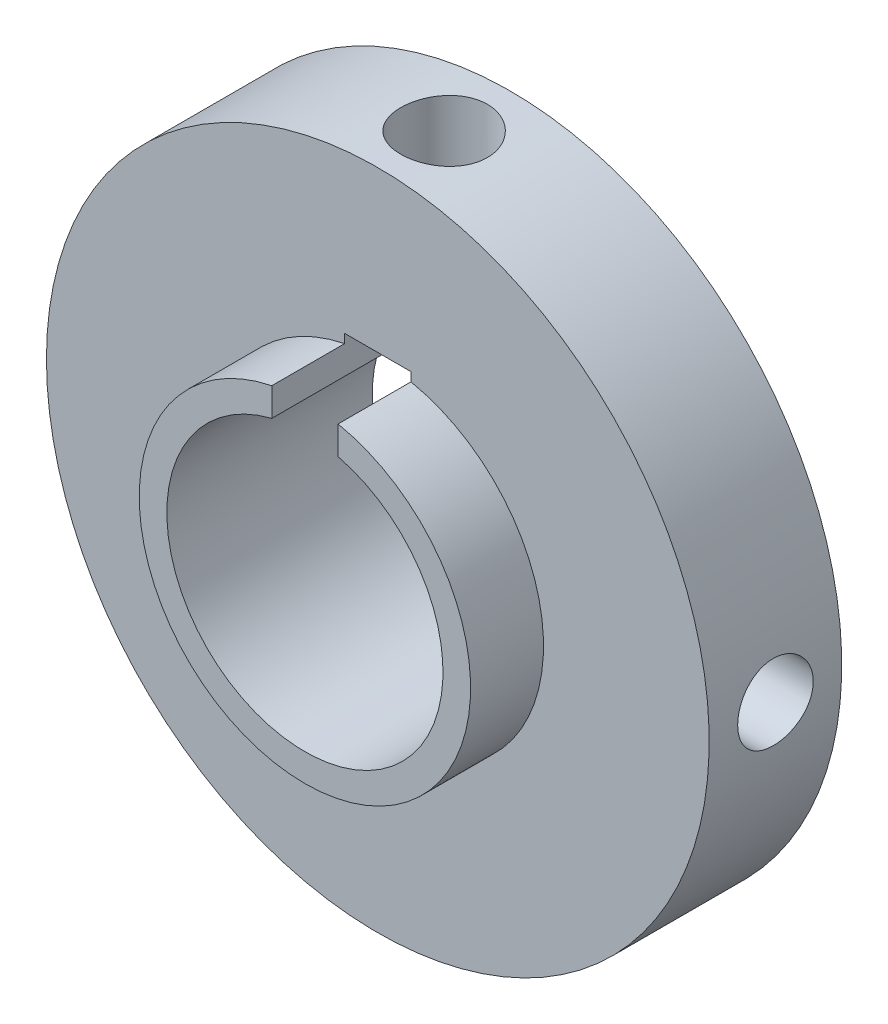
ISO-10303-21;
HEADER;
FILE_DESCRIPTION(('STEP AP214'),'2;1');
FILE_NAME('part.step','',(''),(''),'','','');
FILE_SCHEMA(('AUTOMOTIVE_DESIGN { 1 0 10303 214 1 1 1 1 }'));
ENDSEC;
DATA;
#1=APPLICATION_CONTEXT('core data for automotive mechanical design processes');
#2=APPLICATION_PROTOCOL_DEFINITION('international standard','automotive_design',2000,#1);
#3=PRODUCT_CONTEXT('',#1,'mechanical');
#4=PRODUCT('Part','Part','',(#3));
#5=PRODUCT_RELATED_PRODUCT_CATEGORY('part','',(#4));
#6=PRODUCT_DEFINITION_FORMATION('','',#4);
#7=PRODUCT_DEFINITION_CONTEXT('part definition',#1,'design');
#8=PRODUCT_DEFINITION('design','',#6,#7);
#9=PRODUCT_DEFINITION_SHAPE('','',#8);
#10=(LENGTH_UNIT() NAMED_UNIT(*) SI_UNIT(.MILLI.,.METRE.));
#11=(NAMED_UNIT(*) PLANE_ANGLE_UNIT() SI_UNIT($,.RADIAN.));
#12=(NAMED_UNIT(*) SI_UNIT($,.STERADIAN.) SOLID_ANGLE_UNIT());
#13=UNCERTAINTY_MEASURE_WITH_UNIT(LENGTH_MEASURE(1.E-05),#10,'distance_accuracy_value','');
#14=(GEOMETRIC_REPRESENTATION_CONTEXT(3) GLOBAL_UNCERTAINTY_ASSIGNED_CONTEXT((#13)) GLOBAL_UNIT_ASSIGNED_CONTEXT((#10,
#11,#12)) REPRESENTATION_CONTEXT('',''));
#15=CARTESIAN_POINT('',(0.,0.,0.));
#16=DIRECTION('',(0.,0.,1.));
#17=DIRECTION('',(1.,0.,0.));
#18=AXIS2_PLACEMENT_3D('',#15,#16,#17);
#19=CARTESIAN_POINT('',(0.,0.,-72.8201265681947));
#20=DIRECTION('',(0.,0.,-1.));
#21=DIRECTION('',(-1.,0.,0.));
#22=AXIS2_PLACEMENT_3D('',#19,#20,#21);
#23=CYLINDRICAL_SURFACE('',#22,19.05);
#24=CARTESIAN_POINT('',(0.,19.05,-10.4902));
#25=CARTESIAN_POINT('',(0.139183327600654,19.0499979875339,-10.4901941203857));
#26=CARTESIAN_POINT('',(0.278452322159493,19.0484585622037,-10.4784869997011));
#27=CARTESIAN_POINT('',(0.55311125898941,19.0424655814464,-10.4319718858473));
#28=CARTESIAN_POINT('',(0.688497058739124,19.0380090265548,-10.3971401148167));
#29=CARTESIAN_POINT('',(0.951373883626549,19.0266835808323,-10.3054226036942));
#30=CARTESIAN_POINT('',(1.07887029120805,19.0198163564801,-10.2485520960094));
#31=CARTESIAN_POINT('',(1.32248645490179,19.0044322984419,-10.1144056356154));
#32=CARTESIAN_POINT('',(1.43860807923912,18.9959157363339,-10.0371330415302));
#33=CARTESIAN_POINT('',(1.65689762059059,18.9781259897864,-9.86388113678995));
#34=CARTESIAN_POINT('',(1.75898751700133,18.9688489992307,-9.76780390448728));
#35=CARTESIAN_POINT('',(1.94564343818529,18.9506144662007,-9.55988039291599));
#36=CARTESIAN_POINT('',(2.03020854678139,18.9416569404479,-9.4480332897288));
#37=CARTESIAN_POINT('',(2.1797079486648,18.9250382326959,-9.21123408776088));
#38=CARTESIAN_POINT('',(2.24456861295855,18.9173819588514,-9.08623513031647));
#39=CARTESIAN_POINT('',(2.35234769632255,18.9042832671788,-8.82700190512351));
#40=CARTESIAN_POINT('',(2.39526702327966,18.8988407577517,-8.69276801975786));
#41=CARTESIAN_POINT('',(2.45770684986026,18.8908224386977,-8.41968764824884));
#42=CARTESIAN_POINT('',(2.47735951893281,18.8882304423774,-8.28087186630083));
#43=CARTESIAN_POINT('',(2.49311724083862,18.8861571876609,-8.00189020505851));
#44=CARTESIAN_POINT('',(2.4892233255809,18.8866757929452,-7.86172438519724));
#45=CARTESIAN_POINT('',(2.45810680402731,18.8907503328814,-7.58494518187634));
#46=CARTESIAN_POINT('',(2.43103012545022,18.8942872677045,-7.44831507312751));
#47=CARTESIAN_POINT('',(2.35454452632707,18.9039703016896,-7.18155453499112));
#48=CARTESIAN_POINT('',(2.30513511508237,18.9101164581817,-7.05142424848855));
#49=CARTESIAN_POINT('',(2.18523082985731,18.9243468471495,-6.80090591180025));
#50=CARTESIAN_POINT('',(2.11467288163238,18.9324368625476,-6.68054839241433));
#51=CARTESIAN_POINT('',(1.95451948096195,18.9496390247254,-6.45332677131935));
#52=CARTESIAN_POINT('',(1.86492307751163,18.9587512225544,-6.34646334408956));
#53=CARTESIAN_POINT('',(1.66842896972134,18.9770553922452,-6.14841661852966));
#54=CARTESIAN_POINT('',(1.56140554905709,18.9862474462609,-6.0573580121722));
#55=CARTESIAN_POINT('',(1.33352733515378,19.0036112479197,-5.89447777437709));
#56=CARTESIAN_POINT('',(1.21267250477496,19.0117829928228,-5.82265619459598));
#57=CARTESIAN_POINT('',(0.960463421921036,19.0261911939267,-5.70028734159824));
#58=CARTESIAN_POINT('',(0.829105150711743,19.0324269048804,-5.64974825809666));
#59=CARTESIAN_POINT('',(0.559666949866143,19.0422538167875,-5.57147998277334));
#60=CARTESIAN_POINT('',(0.42158736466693,19.0458451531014,-5.5437496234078));
#61=CARTESIAN_POINT('',(0.143703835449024,19.0499610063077,-5.51204845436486));
#62=CARTESIAN_POINT('',(0.00391979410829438,19.0505076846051,-5.50790594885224));
#63=CARTESIAN_POINT('',(-0.274349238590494,19.0485325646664,-5.52304441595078));
#64=CARTESIAN_POINT('',(-0.41283426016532,19.0460108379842,-5.54232484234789));
#65=CARTESIAN_POINT('',(-0.684064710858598,19.038196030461,-5.60361920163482));
#66=CARTESIAN_POINT('',(-0.816829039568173,19.032912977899,-5.64555089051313));
#67=CARTESIAN_POINT('',(-1.07344170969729,19.020166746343,-5.7508717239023));
#68=CARTESIAN_POINT('',(-1.19728972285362,19.0127034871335,-5.81426165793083));
#69=CARTESIAN_POINT('',(-1.43331849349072,18.996373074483,-5.96111231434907));
#70=CARTESIAN_POINT('',(-1.54542989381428,18.9874982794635,-6.04468364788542));
#71=CARTESIAN_POINT('',(-1.75409645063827,18.9693604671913,-6.22936886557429));
#72=CARTESIAN_POINT('',(-1.85065092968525,18.9600974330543,-6.33048351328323));
#73=CARTESIAN_POINT('',(-2.02607529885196,18.9421583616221,-6.54814314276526));
#74=CARTESIAN_POINT('',(-2.10483109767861,18.9334863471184,-6.66478045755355));
#75=CARTESIAN_POINT('',(-2.24163331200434,18.9177784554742,-6.90972830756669));
#76=CARTESIAN_POINT('',(-2.29968017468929,18.9107425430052,-7.03803859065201));
#77=CARTESIAN_POINT('',(-2.39323372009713,18.8991312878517,-7.30232790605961));
#78=CARTESIAN_POINT('',(-2.42880381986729,18.894549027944,-7.43828417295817));
#79=CARTESIAN_POINT('',(-2.47659789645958,18.8883443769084,-7.7143039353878));
#80=CARTESIAN_POINT('',(-2.48882306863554,18.8867218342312,-7.85436722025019));
#81=CARTESIAN_POINT('',(-2.48955695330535,18.8866250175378,-8.13348968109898));
#82=CARTESIAN_POINT('',(-2.47824493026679,18.8881269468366,-8.27254841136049));
#83=CARTESIAN_POINT('',(-2.4326061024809,18.8940585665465,-8.54676957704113));
#84=CARTESIAN_POINT('',(-2.39827930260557,18.8984882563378,-8.68193201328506));
#85=CARTESIAN_POINT('',(-2.30764297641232,18.9097687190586,-8.94449467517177));
#86=CARTESIAN_POINT('',(-2.25134291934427,18.9166184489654,-9.07189821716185));
#87=CARTESIAN_POINT('',(-2.11837584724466,18.9319688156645,-9.31547899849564));
#88=CARTESIAN_POINT('',(-2.04170848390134,18.9404694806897,-9.43165604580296));
#89=CARTESIAN_POINT('',(-1.86952076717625,18.9582413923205,-9.65040131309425));
#90=CARTESIAN_POINT('',(-1.77386694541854,18.9675178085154,-9.75286406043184));
#91=CARTESIAN_POINT('',(-1.56670135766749,18.9857508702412,-9.94035118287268));
#92=CARTESIAN_POINT('',(-1.45518587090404,18.9947074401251,-10.0253714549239));
#93=CARTESIAN_POINT('',(-1.21892803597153,19.0113330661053,-10.1758643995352));
#94=CARTESIAN_POINT('',(-1.09413272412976,19.0189966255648,-10.2412544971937));
#95=CARTESIAN_POINT('',(-0.835299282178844,19.032117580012,-10.350054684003));
#96=CARTESIAN_POINT('',(-0.701271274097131,19.0375773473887,-10.3934884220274));
#97=CARTESIAN_POINT('',(-0.472140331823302,19.0443740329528,-10.4468599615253));
#98=CARTESIAN_POINT('',(-0.37847635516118,19.0464733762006,-10.4630888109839));
#99=CARTESIAN_POINT('',(-0.189888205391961,19.0492870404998,-10.4847607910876));
#100=CARTESIAN_POINT('',(-0.0949640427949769,19.0500013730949,-10.4902040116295));
#101=CARTESIAN_POINT('',(0.,19.05,-10.4902));
#102=B_SPLINE_CURVE_WITH_KNOTS('',3,(#24,#25,#26,#27,#28,#29,#30,#31,#32,#33,#34,#35,#36,#37,
#38,#39,#40,#41,#42,#43,#44,#45,#46,#47,#48,#49,#50,#51,#52,#53,#54,#55,#56,#57,#58,#59,#60,#61,
#62,#63,#64,#65,#66,#67,#68,#69,#70,#71,#72,#73,#74,#75,#76,#77,#78,#79,#80,#81,#82,#83,#84,#85,
#86,#87,#88,#89,#90,#91,#92,#93,#94,#95,#96,#97,#98,#99,#100,#101),.UNSPECIFIED.,.T.,.F.,(4,2,2,
2,2,2,2,2,2,2,2,2,2,2,2,2,2,2,2,2,2,2,2,2,2,2,2,2,2,2,2,2,2,2,2,2,2,2,4),(0.,0.417203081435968,
0.834835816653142,1.25218041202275,1.66945634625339,2.08896593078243,2.50849744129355,
2.92957784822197,3.35064083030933,3.76930025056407,4.18794132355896,4.60396640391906,
5.02000062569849,5.43728820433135,5.85459663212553,6.27506093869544,6.69552637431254,
7.11615346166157,7.53675901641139,7.95429903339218,8.37182931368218,8.78785368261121,
9.20389336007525,9.62226721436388,10.0406592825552,10.4616616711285,10.8826549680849,
11.3024550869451,11.7222337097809,12.1388269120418,12.5554200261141,12.9718338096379,
13.3882547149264,13.8077137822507,14.2272714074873,14.6485699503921,15.0694137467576,
15.3540715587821,15.6387269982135),.UNSPECIFIED.);
#103=CARTESIAN_POINT('',(0.,19.05,-10.4902));
#104=VERTEX_POINT('',#103);
#105=EDGE_CURVE('E188',#104,#104,#102,.T.);
#106=ORIENTED_EDGE('',*,*,#105,.T.);
#107=EDGE_LOOP('',(#106));
#108=FACE_BOUND('',#107,.T.);
#109=CARTESIAN_POINT('',(0.,0.,-11.811));
#110=DIRECTION('',(0.,0.,-1.));
#111=DIRECTION('',(-1.,0.,0.));
#112=AXIS2_PLACEMENT_3D('',#109,#110,#111);
#113=CIRCLE('',#112,19.05);
#114=CARTESIAN_POINT('',(-19.05,0.,-11.811));
#115=VERTEX_POINT('',#114);
#116=EDGE_CURVE('E163',#115,#115,#113,.T.);
#117=ORIENTED_EDGE('',*,*,#116,.F.);
#118=EDGE_LOOP('',(#117));
#119=FACE_BOUND('',#118,.T.);
#120=CARTESIAN_POINT('',(0.,0.,-4.191));
#121=DIRECTION('',(0.,0.,-1.));
#122=DIRECTION('',(-1.,0.,0.));
#123=AXIS2_PLACEMENT_3D('',#120,#121,#122);
#124=CIRCLE('',#123,19.05);
#125=CARTESIAN_POINT('',(-19.05,0.,-4.191));
#126=VERTEX_POINT('',#125);
#127=EDGE_CURVE('E166',#126,#126,#124,.T.);
#128=ORIENTED_EDGE('',*,*,#127,.T.);
#129=EDGE_LOOP('',(#128));
#130=FACE_BOUND('',#129,.T.);
#131=CARTESIAN_POINT('',(19.05,0.,-5.8293));
#132=CARTESIAN_POINT('',(19.0499984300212,0.121562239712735,-5.82930521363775));
#133=CARTESIAN_POINT('',(19.0488241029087,0.243202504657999,-5.83954117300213));
#134=CARTESIAN_POINT('',(19.044252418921,0.483104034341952,-5.88021614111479));
#135=CARTESIAN_POINT('',(19.0408526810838,0.601361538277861,-5.91067678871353));
#136=CARTESIAN_POINT('',(19.0322135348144,0.830989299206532,-5.99089705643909));
#137=CARTESIAN_POINT('',(19.0269753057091,0.942363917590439,-6.04064430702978));
#138=CARTESIAN_POINT('',(19.0152432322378,1.15516050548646,-6.15799995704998));
#139=CARTESIAN_POINT('',(19.0087496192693,1.25658430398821,-6.22560506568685));
#140=CARTESIAN_POINT('',(18.9951993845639,1.44709104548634,-6.37709156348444));
#141=CARTESIAN_POINT('',(18.988140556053,1.53612148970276,-6.46103878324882));
#142=CARTESIAN_POINT('',(18.9742734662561,1.69886253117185,-6.64268553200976));
#143=CARTESIAN_POINT('',(18.9674652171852,1.77257238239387,-6.7403857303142));
#144=CARTESIAN_POINT('',(18.9548481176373,1.90277133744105,-6.94710088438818));
#145=CARTESIAN_POINT('',(18.9490420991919,1.95921197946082,-7.05614655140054));
#146=CARTESIAN_POINT('',(18.9391152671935,2.05296092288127,-7.28224527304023));
#147=CARTESIAN_POINT('',(18.9349944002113,2.09026983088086,-7.39929807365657));
#148=CARTESIAN_POINT('',(18.9289250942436,2.14453836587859,-7.63754733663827));
#149=CARTESIAN_POINT('',(18.9269672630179,2.16158599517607,-7.75872351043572));
#150=CARTESIAN_POINT('',(18.9254167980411,2.17512023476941,-8.00223160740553));
#151=CARTESIAN_POINT('',(18.925824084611,2.17160753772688,-8.12456349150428));
#152=CARTESIAN_POINT('',(18.9289492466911,2.14419320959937,-8.36630028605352));
#153=CARTESIAN_POINT('',(18.9316561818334,2.12038811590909,-8.48571630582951));
#154=CARTESIAN_POINT('',(18.9390585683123,2.05321516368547,-8.71884729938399));
#155=CARTESIAN_POINT('',(18.9437540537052,2.00984697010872,-8.83256217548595));
#156=CARTESIAN_POINT('',(18.954616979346,1.90467381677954,-9.05136520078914));
#157=CARTESIAN_POINT('',(18.9607877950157,1.84282649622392,-9.15643281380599));
#158=CARTESIAN_POINT('',(18.9739033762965,1.70248107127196,-9.35473394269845));
#159=CARTESIAN_POINT('',(18.9808481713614,1.62398233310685,-9.44796700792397));
#160=CARTESIAN_POINT('',(18.9947779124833,1.45202540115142,-9.62051313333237));
#161=CARTESIAN_POINT('',(19.0017628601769,1.35848392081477,-9.69974321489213));
#162=CARTESIAN_POINT('',(19.0149484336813,1.15938470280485,-9.84138961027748));
#163=CARTESIAN_POINT('',(19.0211490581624,1.0538269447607,-9.90380589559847));
#164=CARTESIAN_POINT('',(19.0320703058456,0.833630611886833,-10.010051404));
#165=CARTESIAN_POINT('',(19.0367905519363,0.718989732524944,-10.0538758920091));
#166=CARTESIAN_POINT('',(19.0442156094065,0.48391082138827,-10.1216302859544));
#167=CARTESIAN_POINT('',(19.0469204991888,0.363473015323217,-10.1455609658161));
#168=CARTESIAN_POINT('',(19.049999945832,0.120937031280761,-10.1727419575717));
#169=CARTESIAN_POINT('',(19.0503873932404,-0.00114816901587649,-10.1761066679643));
#170=CARTESIAN_POINT('',(19.0488229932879,-0.244143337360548,-10.1623614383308));
#171=CARTESIAN_POINT('',(19.0468711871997,-0.365053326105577,-10.1452518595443));
#172=CARTESIAN_POINT('',(19.0408557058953,-0.601931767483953,-10.0911387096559));
#173=CARTESIAN_POINT('',(19.0367977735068,-0.717912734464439,-10.0541892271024));
#174=CARTESIAN_POINT('',(19.0270247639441,-0.942031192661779,-9.96150105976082));
#175=CARTESIAN_POINT('',(19.0213096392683,-1.05016845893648,-9.9057618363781));
#176=CARTESIAN_POINT('',(19.008828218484,-1.25604377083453,-9.77679640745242));
#177=CARTESIAN_POINT('',(19.0020574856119,-1.35373484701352,-9.70349565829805));
#178=CARTESIAN_POINT('',(18.9882374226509,-1.53546794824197,-9.54159403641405));
#179=CARTESIAN_POINT('',(18.9811880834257,-1.61950952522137,-9.45299266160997));
#180=CARTESIAN_POINT('',(18.967565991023,-1.77195984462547,-9.26250312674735));
#181=CARTESIAN_POINT('',(18.9609956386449,-1.84029310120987,-9.16055435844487));
#182=CARTESIAN_POINT('',(18.9491136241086,-1.9588667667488,-8.94656033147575));
#183=CARTESIAN_POINT('',(18.9438019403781,-2.00910748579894,-8.83451524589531));
#184=CARTESIAN_POINT('',(18.9350544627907,-2.08994576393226,-8.60375982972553));
#185=CARTESIAN_POINT('',(18.9316145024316,-2.1205869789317,-8.48506495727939));
#186=CARTESIAN_POINT('',(18.9269875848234,-2.16149756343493,-8.24417333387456));
#187=CARTESIAN_POINT('',(18.9258005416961,-2.17176770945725,-8.12197671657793));
#188=CARTESIAN_POINT('',(18.925816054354,-2.17163200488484,-7.87830092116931));
#189=CARTESIAN_POINT('',(18.9270049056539,-2.16134473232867,-7.75682165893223));
#190=CARTESIAN_POINT('',(18.9316089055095,-2.12063615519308,-7.51732997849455));
#191=CARTESIAN_POINT('',(18.9350240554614,-2.09021483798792,-7.399317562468));
#192=CARTESIAN_POINT('',(18.9436918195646,-2.01013681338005,-7.17011833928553));
#193=CARTESIAN_POINT('',(18.9489439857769,-1.96048479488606,-7.05892987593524));
#194=CARTESIAN_POINT('',(18.9606948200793,-1.84336662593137,-6.84644475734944));
#195=CARTESIAN_POINT('',(18.9671934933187,-1.7759004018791,-6.74514814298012));
#196=CARTESIAN_POINT('',(18.9807500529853,-1.62462611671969,-6.55471503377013));
#197=CARTESIAN_POINT('',(18.987810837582,-1.54072960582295,-6.46564900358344));
#198=CARTESIAN_POINT('',(19.0016699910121,-1.35915769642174,-6.30281157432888));
#199=CARTESIAN_POINT('',(19.0084682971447,-1.26147903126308,-6.22904381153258));
#200=CARTESIAN_POINT('',(19.0210599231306,-1.05476434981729,-6.09870247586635));
#201=CARTESIAN_POINT('',(19.0268499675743,-0.945693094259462,-6.04218450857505));
#202=CARTESIAN_POINT('',(19.0367386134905,-0.719607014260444,-5.94834454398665));
#203=CARTESIAN_POINT('',(19.0408390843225,-0.602601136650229,-5.91100132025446));
#204=CARTESIAN_POINT('',(19.0458784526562,-0.404135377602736,-5.86568474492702));
#205=CARTESIAN_POINT('',(19.0474166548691,-0.323935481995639,-5.85205961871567));
#206=CARTESIAN_POINT('',(19.0494779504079,-0.162502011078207,-5.833865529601));
#207=CARTESIAN_POINT('',(19.0500010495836,-0.0812684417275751,-5.82929651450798));
#208=CARTESIAN_POINT('',(19.05,0.,-5.8293));
#209=B_SPLINE_CURVE_WITH_KNOTS('',3,(#131,#132,#133,#134,#135,#136,#137,#138,#139,#140,#141,
#142,#143,#144,#145,#146,#147,#148,#149,#150,#151,#152,#153,#154,#155,#156,#157,#158,#159,#160,
#161,#162,#163,#164,#165,#166,#167,#168,#169,#170,#171,#172,#173,#174,#175,#176,#177,#178,#179,
#180,#181,#182,#183,#184,#185,#186,#187,#188,#189,#190,#191,#192,#193,#194,#195,#196,#197,#198,
#199,#200,#201,#202,#203,#204,#205,#206,#207,#208),.UNSPECIFIED.,.T.,.F.,(4,2,2,2,2,2,2,2,2,2,2,
2,2,2,2,2,2,2,2,2,2,2,2,2,2,2,2,2,2,2,2,2,2,2,2,2,2,2,4),(0.,0.364389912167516,
0.729170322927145,1.0937171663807,1.45819687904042,1.82417639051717,2.19017371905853,
2.55718890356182,2.92419245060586,3.28959606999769,3.65498737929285,4.01865004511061,
4.38231893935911,4.74682797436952,5.11135088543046,5.47796630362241,5.84458234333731,
6.21129169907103,6.57798678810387,6.94264026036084,7.30728729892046,7.67094522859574,
8.03461358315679,8.39985384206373,8.76510608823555,9.13207846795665,9.49904455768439,
9.86519039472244,10.2313222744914,10.5953483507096,10.9593746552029,11.3233122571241,
11.6872513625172,12.0532063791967,12.4192482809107,12.7864579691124,13.1532602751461,
13.396868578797,13.6404754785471),.UNSPECIFIED.);
#210=CARTESIAN_POINT('',(19.05,0.,-5.8293));
#211=VERTEX_POINT('',#210);
#212=EDGE_CURVE('E232',#211,#211,#209,.T.);
#213=ORIENTED_EDGE('',*,*,#212,.T.);
#214=EDGE_LOOP('',(#213));
#215=FACE_BOUND('',#214,.T.);
#216=ADVANCED_FACE('F34',(#108,#119,#130,#215),#23,.T.);
#217=CARTESIAN_POINT('',(0.,0.,-72.8201265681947));
#218=DIRECTION('',(0.,0.,-1.));
#219=DIRECTION('',(-1.,0.,0.));
#220=AXIS2_PLACEMENT_3D('',#217,#218,#219);
#221=CYLINDRICAL_SURFACE('',#220,7.93750000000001);
#222=CARTESIAN_POINT('',(-1.905,7.70550979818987,-9.60321460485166));
#223=CARTESIAN_POINT('',(-1.94925234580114,7.69456907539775,-9.55059524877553));
#224=CARTESIAN_POINT('',(-1.99132159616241,7.68376449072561,-9.49615175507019));
#225=CARTESIAN_POINT('',(-2.07086297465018,7.66271007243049,-9.3838897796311));
#226=CARTESIAN_POINT('',(-2.10833432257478,7.65246033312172,-9.32607072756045));
#227=CARTESIAN_POINT('',(-2.21350847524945,7.62296581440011,-9.14794583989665));
#228=CARTESIAN_POINT('',(-2.27393957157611,7.60498392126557,-9.02301010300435));
#229=CARTESIAN_POINT('',(-2.3734254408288,7.57452936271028,-8.76405715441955));
#230=CARTESIAN_POINT('',(-2.41244377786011,7.56206609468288,-8.63002489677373));
#231=CARTESIAN_POINT('',(-2.46753829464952,7.54427032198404,-8.35698353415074));
#232=CARTESIAN_POINT('',(-2.48364170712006,7.53892935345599,-8.21798053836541));
#233=CARTESIAN_POINT('',(-2.49219586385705,7.53610516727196,-7.94379298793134));
#234=CARTESIAN_POINT('',(-2.48541133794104,7.53836788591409,-7.80863420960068));
#235=CARTESIAN_POINT('',(-2.45011371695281,7.54991291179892,-7.5414003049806));
#236=CARTESIAN_POINT('',(-2.42158548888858,7.55920010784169,-7.40932739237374));
#237=CARTESIAN_POINT('',(-2.34413262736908,7.58357229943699,-7.15308996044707));
#238=CARTESIAN_POINT('',(-2.29537240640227,7.59861048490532,-7.02887078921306));
#239=CARTESIAN_POINT('',(-2.17900096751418,7.63279155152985,-6.79036729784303));
#240=CARTESIAN_POINT('',(-2.11141720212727,7.65192844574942,-6.67606882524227));
#241=CARTESIAN_POINT('',(-2.01487655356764,7.67754059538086,-6.53892305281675));
#242=CARTESIAN_POINT('',(-1.99371941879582,7.68306538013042,-6.51020342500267));
#243=CARTESIAN_POINT('',(-1.95023582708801,7.69421793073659,-6.45375714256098));
#244=CARTESIAN_POINT('',(-1.927911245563,7.69984552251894,-6.42602900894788));
#245=CARTESIAN_POINT('',(-1.90500000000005,7.70550979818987,-6.39878539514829));
#246=B_SPLINE_CURVE_WITH_KNOTS('',3,(#222,#223,#224,#225,#226,#227,#228,#229,#230,#231,#232,
#233,#234,#235,#236,#237,#238,#239,#240,#241,#242,#243,#244,#245),.UNSPECIFIED.,.F.,.F.,(4,2,2,
2,2,2,2,2,2,2,2,4),(0.,0.208735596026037,0.417506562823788,0.835196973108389,1.25359593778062,
1.67149724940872,2.07557584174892,2.47993591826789,2.88107244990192,3.28162699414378,
3.38989694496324,3.4979980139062),.UNSPECIFIED.);
#247=CARTESIAN_POINT('',(-1.905,7.70550979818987,-9.60321460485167));
#248=VERTEX_POINT('',#247);
#249=CARTESIAN_POINT('',(-1.905,7.70550979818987,-6.39878539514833));
#250=VERTEX_POINT('',#249);
#251=EDGE_CURVE('E131',#248,#250,#246,.T.);
#252=ORIENTED_EDGE('',*,*,#251,.T.);
#253=DIRECTION('',(0.,0.,-1.));
#254=VECTOR('',#253,1.);
#255=CARTESIAN_POINT('',(-1.905,7.70550979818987,23.8357719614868));
#256=LINE('',#255,#254);
#257=CARTESIAN_POINT('',(-1.905,7.70550979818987,0.));
#258=VERTEX_POINT('',#257);
#259=EDGE_CURVE('E201',#258,#250,#256,.T.);
#260=ORIENTED_EDGE('',*,*,#259,.F.);
#261=CARTESIAN_POINT('',(0.,0.,0.));
#262=DIRECTION('',(0.,0.,-1.));
#263=DIRECTION('',(-1.,0.,0.));
#264=AXIS2_PLACEMENT_3D('',#261,#262,#263);
#265=CIRCLE('',#264,7.93750000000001);
#266=CARTESIAN_POINT('',(1.905,7.70550979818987,0.));
#267=VERTEX_POINT('',#266);
#268=EDGE_CURVE('E158',#267,#258,#265,.T.);
#269=ORIENTED_EDGE('',*,*,#268,.F.);
#270=DIRECTION('',(0.,0.,-1.));
#271=VECTOR('',#270,1.);
#272=CARTESIAN_POINT('',(1.905,7.70550979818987,23.8357719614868));
#273=LINE('',#272,#271);
#274=CARTESIAN_POINT('',(1.905,7.70550979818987,-6.39878539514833));
#275=VERTEX_POINT('',#274);
#276=EDGE_CURVE('E138',#267,#275,#273,.T.);
#277=ORIENTED_EDGE('',*,*,#276,.T.);
#278=CARTESIAN_POINT('',(1.905,7.70550979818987,-6.39878539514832));
#279=CARTESIAN_POINT('',(1.94925234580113,7.69456907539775,-6.45140475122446));
#280=CARTESIAN_POINT('',(1.9913215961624,7.68376449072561,-6.5058482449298));
#281=CARTESIAN_POINT('',(2.07086297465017,7.66271007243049,-6.61811022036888));
#282=CARTESIAN_POINT('',(2.10833432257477,7.65246033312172,-6.67592927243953));
#283=CARTESIAN_POINT('',(2.21350847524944,7.62296581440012,-6.85405416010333));
#284=CARTESIAN_POINT('',(2.27393957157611,7.60498392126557,-6.97898989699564));
#285=CARTESIAN_POINT('',(2.3734254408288,7.57452936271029,-7.23794284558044));
#286=CARTESIAN_POINT('',(2.41244377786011,7.56206609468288,-7.37197510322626));
#287=CARTESIAN_POINT('',(2.46753829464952,7.54427032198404,-7.64501646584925));
#288=CARTESIAN_POINT('',(2.48364170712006,7.53892935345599,-7.78401946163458));
#289=CARTESIAN_POINT('',(2.49219586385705,7.53610516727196,-8.05820701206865));
#290=CARTESIAN_POINT('',(2.48541133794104,7.53836788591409,-8.19336579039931));
#291=CARTESIAN_POINT('',(2.45011371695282,7.54991291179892,-8.46059969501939));
#292=CARTESIAN_POINT('',(2.42158548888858,7.55920010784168,-8.59267260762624));
#293=CARTESIAN_POINT('',(2.34413262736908,7.58357229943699,-8.84891003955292));
#294=CARTESIAN_POINT('',(2.29537240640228,7.59861048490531,-8.97312921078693));
#295=CARTESIAN_POINT('',(2.17900096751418,7.63279155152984,-9.21163270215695));
#296=CARTESIAN_POINT('',(2.11141720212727,7.65192844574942,-9.32593117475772));
#297=CARTESIAN_POINT('',(2.01487655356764,7.67754059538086,-9.46307694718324));
#298=CARTESIAN_POINT('',(1.99371941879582,7.68306538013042,-9.49179657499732));
#299=CARTESIAN_POINT('',(1.95023582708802,7.69421793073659,-9.54824285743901));
#300=CARTESIAN_POINT('',(1.92791124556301,7.69984552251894,-9.57597099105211));
#301=CARTESIAN_POINT('',(1.90500000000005,7.70550979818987,-9.6032146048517));
#302=B_SPLINE_CURVE_WITH_KNOTS('',3,(#278,#279,#280,#281,#282,#283,#284,#285,#286,#287,#288,
#289,#290,#291,#292,#293,#294,#295,#296,#297,#298,#299,#300,#301),.UNSPECIFIED.,.F.,.F.,(4,2,2,
2,2,2,2,2,2,2,2,4),(0.,0.208735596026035,0.417506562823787,0.83519697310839,1.25359593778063,
1.67149724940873,2.07557584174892,2.47993591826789,2.88107244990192,3.28162699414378,
3.38989694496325,3.4979980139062),.UNSPECIFIED.);
#303=CARTESIAN_POINT('',(1.905,7.70550979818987,-9.60321460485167));
#304=VERTEX_POINT('',#303);
#305=EDGE_CURVE('E117',#275,#304,#302,.T.);
#306=ORIENTED_EDGE('',*,*,#305,.T.);
#307=CARTESIAN_POINT('',(1.905,7.70550979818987,-11.811));
#308=VERTEX_POINT('',#307);
#309=EDGE_CURVE('E57',#304,#308,#273,.T.);
#310=ORIENTED_EDGE('',*,*,#309,.T.);
#311=CARTESIAN_POINT('',(0.,0.,-11.811));
#312=DIRECTION('',(0.,0.,-1.));
#313=DIRECTION('',(-1.,0.,0.));
#314=AXIS2_PLACEMENT_3D('',#311,#312,#313);
#315=CIRCLE('',#314,7.93750000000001);
#316=CARTESIAN_POINT('',(-1.905,7.70550979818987,-11.811));
#317=VERTEX_POINT('',#316);
#318=EDGE_CURVE('E161',#308,#317,#315,.T.);
#319=ORIENTED_EDGE('',*,*,#318,.T.);
#320=EDGE_CURVE('E202',#248,#317,#256,.T.);
#321=ORIENTED_EDGE('',*,*,#320,.F.);
#322=EDGE_LOOP('',(#252,#260,#269,#277,#306,#310,#319,#321));
#323=FACE_BOUND('',#322,.T.);
#324=CARTESIAN_POINT('',(7.93750000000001,0.,-5.8293));
#325=CARTESIAN_POINT('',(7.93749831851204,-0.119603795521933,-5.82930259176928));
#326=CARTESIAN_POINT('',(7.93477022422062,-0.239234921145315,-5.83921361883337));
#327=CARTESIAN_POINT('',(7.92415254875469,-0.475043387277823,-5.87852097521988));
#328=CARTESIAN_POINT('',(7.91626067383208,-0.59121916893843,-5.90792596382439));
#329=CARTESIAN_POINT('',(7.89618524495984,-0.816679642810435,-5.98518799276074));
#330=CARTESIAN_POINT('',(7.88400738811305,-0.925973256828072,-6.03302054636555));
#331=CARTESIAN_POINT('',(7.85664270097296,-1.13498762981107,-6.14568718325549));
#332=CARTESIAN_POINT('',(7.84145562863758,-1.23470761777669,-6.21052263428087));
#333=CARTESIAN_POINT('',(7.80929562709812,-1.42416712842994,-6.35701739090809));
#334=CARTESIAN_POINT('',(7.79229092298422,-1.51364091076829,-6.43901340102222));
#335=CARTESIAN_POINT('',(7.75861325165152,-1.67775445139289,-6.61678239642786));
#336=CARTESIAN_POINT('',(7.74194032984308,-1.75239219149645,-6.71255725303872));
#337=CARTESIAN_POINT('',(7.71048682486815,-1.88603083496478,-6.91731160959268));
#338=CARTESIAN_POINT('',(7.69574621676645,-1.94472233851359,-7.02649975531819));
#339=CARTESIAN_POINT('',(7.67029507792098,-2.04280821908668,-7.25366296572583));
#340=CARTESIAN_POINT('',(7.65958376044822,-2.08220636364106,-7.37163630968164));
#341=CARTESIAN_POINT('',(7.64373265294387,-2.13965718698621,-7.61006942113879));
#342=CARTESIAN_POINT('',(7.6384669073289,-2.15819334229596,-7.7304041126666));
#343=CARTESIAN_POINT('',(7.63372713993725,-2.17490185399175,-7.97258153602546));
#344=CARTESIAN_POINT('',(7.63425197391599,-2.1730782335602,-8.09442396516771));
#345=CARTESIAN_POINT('',(7.64092154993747,-2.1495019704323,-8.33235405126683));
#346=CARTESIAN_POINT('',(7.64690018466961,-2.12833833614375,-8.4485054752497));
#347=CARTESIAN_POINT('',(7.66353720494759,-2.06762781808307,-8.67554247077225));
#348=CARTESIAN_POINT('',(7.67419598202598,-2.02807939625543,-8.78642760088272));
#349=CARTESIAN_POINT('',(7.69913564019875,-1.93125133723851,-9.00130072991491));
#350=CARTESIAN_POINT('',(7.7134577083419,-1.87376832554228,-9.10519209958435));
#351=CARTESIAN_POINT('',(7.74408854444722,-1.74284457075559,-9.30205938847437));
#352=CARTESIAN_POINT('',(7.7603977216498,-1.66940053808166,-9.39503305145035));
#353=CARTESIAN_POINT('',(7.79385306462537,-1.50564504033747,-9.57078634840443));
#354=CARTESIAN_POINT('',(7.81100871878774,-1.41484006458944,-9.65310503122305));
#355=CARTESIAN_POINT('',(7.84372187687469,-1.22050336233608,-9.80144309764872));
#356=CARTESIAN_POINT('',(7.85927931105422,-1.11697108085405,-9.86746177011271));
#357=CARTESIAN_POINT('',(7.88714733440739,-0.899380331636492,-9.98154366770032));
#358=CARTESIAN_POINT('',(7.8994420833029,-0.785274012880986,-10.029519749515));
#359=CARTESIAN_POINT('',(7.91928512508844,-0.550201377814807,-10.1054729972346));
#360=CARTESIAN_POINT('',(7.92683451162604,-0.429236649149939,-10.1334547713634));
#361=CARTESIAN_POINT('',(7.93616930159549,-0.187811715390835,-10.1678927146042));
#362=CARTESIAN_POINT('',(7.93812235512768,-0.0674471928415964,-10.1749751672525));
#363=CARTESIAN_POINT('',(7.93652838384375,0.17275111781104,-10.1691481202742));
#364=CARTESIAN_POINT('',(7.93298195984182,0.292584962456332,-10.1562408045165));
#365=CARTESIAN_POINT('',(7.92089613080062,0.526059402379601,-10.1113130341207));
#366=CARTESIAN_POINT('',(7.91244890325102,0.639773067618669,-10.0796452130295));
#367=CARTESIAN_POINT('',(7.8915228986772,0.860260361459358,-9.99850778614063));
#368=CARTESIAN_POINT('',(7.87904367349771,0.967033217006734,-9.94903620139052));
#369=CARTESIAN_POINT('',(7.85104911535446,1.17301600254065,-9.83255618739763));
#370=CARTESIAN_POINT('',(7.83547717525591,1.27202785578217,-9.76521143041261));
#371=CARTESIAN_POINT('',(7.80309543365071,1.45756401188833,-9.61531662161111));
#372=CARTESIAN_POINT('',(7.78628537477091,1.54408570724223,-9.53276340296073));
#373=CARTESIAN_POINT('',(7.75269961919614,1.70484902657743,-9.35186717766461));
#374=CARTESIAN_POINT('',(7.73593987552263,1.7786478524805,-9.25312693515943));
#375=CARTESIAN_POINT('',(7.70489934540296,1.90864236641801,-9.04430644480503));
#376=CARTESIAN_POINT('',(7.69061846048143,1.96483875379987,-8.93422664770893));
#377=CARTESIAN_POINT('',(7.66631840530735,2.05761261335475,-8.70637309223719));
#378=CARTESIAN_POINT('',(7.65627520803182,2.09430101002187,-8.58864720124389));
#379=CARTESIAN_POINT('',(7.64159275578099,2.14726246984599,-8.34837301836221));
#380=CARTESIAN_POINT('',(7.63695203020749,2.16354108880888,-8.22582604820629));
#381=CARTESIAN_POINT('',(7.63372733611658,2.17488915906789,-7.98393434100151));
#382=CARTESIAN_POINT('',(7.63493958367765,2.17067217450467,-7.86462530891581));
#383=CARTESIAN_POINT('',(7.64280455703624,2.14281354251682,-7.6284891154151));
#384=CARTESIAN_POINT('',(7.64945712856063,2.11917244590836,-7.51166188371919));
#385=CARTESIAN_POINT('',(7.66732866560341,2.05356026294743,-7.28475682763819));
#386=CARTESIAN_POINT('',(7.67850803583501,2.01174789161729,-7.17462976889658));
#387=CARTESIAN_POINT('',(7.7041726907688,1.91110294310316,-6.96286898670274));
#388=CARTESIAN_POINT('',(7.71865851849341,1.85226756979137,-6.86123666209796));
#389=CARTESIAN_POINT('',(7.74986207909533,1.71711600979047,-6.66596285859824));
#390=CARTESIAN_POINT('',(7.76663488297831,1.64031650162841,-6.572664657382));
#391=CARTESIAN_POINT('',(7.80022354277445,1.47232606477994,-6.40004832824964));
#392=CARTESIAN_POINT('',(7.81703940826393,1.38113160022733,-6.32073364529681));
#393=CARTESIAN_POINT('',(7.8492798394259,1.18442305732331,-6.17654662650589));
#394=CARTESIAN_POINT('',(7.86466377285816,1.0786291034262,-6.11204622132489));
#395=CARTESIAN_POINT('',(7.89185484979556,0.857280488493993,-6.0018465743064));
#396=CARTESIAN_POINT('',(7.90366416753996,0.741731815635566,-5.95613589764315));
#397=CARTESIAN_POINT('',(7.92094506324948,0.522265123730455,-5.89041153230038));
#398=CARTESIAN_POINT('',(7.92710675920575,0.419245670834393,-5.86754961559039));
#399=CARTESIAN_POINT('',(7.93538474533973,0.210824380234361,-5.83699354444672));
#400=CARTESIAN_POINT('',(7.93750148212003,0.105422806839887,-5.82929771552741));
#401=CARTESIAN_POINT('',(7.93750000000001,0.,-5.8293));
#402=B_SPLINE_CURVE_WITH_KNOTS('',3,(#324,#325,#326,#327,#328,#329,#330,#331,#332,#333,#334,
#335,#336,#337,#338,#339,#340,#341,#342,#343,#344,#345,#346,#347,#348,#349,#350,#351,#352,#353,
#354,#355,#356,#357,#358,#359,#360,#361,#362,#363,#364,#365,#366,#367,#368,#369,#370,#371,#372,
#373,#374,#375,#376,#377,#378,#379,#380,#381,#382,#383,#384,#385,#386,#387,#388,#389,#390,#391,
#392,#393,#394,#395,#396,#397,#398,#399,#400,#401),.UNSPECIFIED.,.T.,.F.,(4,2,2,2,2,2,2,2,2,2,2,
2,2,2,2,2,2,2,2,2,2,2,2,2,2,2,2,2,2,2,2,2,2,2,2,2,2,2,4),(0.,0.358424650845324,
0.717008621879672,1.07511773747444,1.43325566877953,1.79922037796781,2.16523483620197,
2.5379124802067,2.91051732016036,3.27429680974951,3.63800441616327,3.99099144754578,
4.34400801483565,4.70118288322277,5.05843143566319,5.42797483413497,5.79753435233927,
6.16885654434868,6.54009312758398,6.90008596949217,7.2600394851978,7.61343267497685,
7.96686515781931,8.32748863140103,8.6881872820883,9.05963510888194,9.43106817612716,
9.80036601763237,10.1695633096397,10.526000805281,10.8824281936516,11.2358030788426,
11.5892360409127,11.9535732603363,12.3180001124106,12.6907644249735,13.0633015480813,
13.3792639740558,13.6951915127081),.UNSPECIFIED.);
#403=CARTESIAN_POINT('',(7.93750000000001,0.,-5.8293));
#404=VERTEX_POINT('',#403);
#405=EDGE_CURVE('E237',#404,#404,#402,.T.);
#406=ORIENTED_EDGE('',*,*,#405,.T.);
#407=EDGE_LOOP('',(#406));
#408=FACE_BOUND('',#407,.T.);
#409=ADVANCED_FACE('F208',(#323,#408),#221,.F.);
#410=CARTESIAN_POINT('',(1.905,9.8425,23.8357719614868));
#411=DIRECTION('',(0.,1.,0.));
#412=DIRECTION('',(0.,0.,1.));
#413=AXIS2_PLACEMENT_3D('',#410,#411,#412);
#414=PLANE('',#413);
#415=CARTESIAN_POINT('',(0.,9.8425,-8.001));
#416=DIRECTION('',(0.,1.,0.));
#417=DIRECTION('',(0.,0.,1.));
#418=AXIS2_PLACEMENT_3D('',#415,#416,#417);
#419=CIRCLE('',#418,2.4892);
#420=CARTESIAN_POINT('',(1.905,9.8425,-9.60321460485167));
#421=VERTEX_POINT('',#420);
#422=CARTESIAN_POINT('',(-1.905,9.8425,-9.60321460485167));
#423=VERTEX_POINT('',#422);
#424=EDGE_CURVE('E49',#421,#423,#419,.T.);
#425=ORIENTED_EDGE('',*,*,#424,.T.);
#426=DIRECTION('',(0.,0.,-1.));
#427=VECTOR('',#426,1.);
#428=CARTESIAN_POINT('',(-1.905,9.8425,23.8357719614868));
#429=LINE('',#428,#427);
#430=CARTESIAN_POINT('',(-1.905,9.8425,-11.811));
#431=VERTEX_POINT('',#430);
#432=EDGE_CURVE('E184',#423,#431,#429,.T.);
#433=ORIENTED_EDGE('',*,*,#432,.T.);
#434=DIRECTION('',(1.,0.,0.));
#435=VECTOR('',#434,1.);
#436=CARTESIAN_POINT('',(1.905,9.8425,-11.811));
#437=LINE('',#436,#435);
#438=CARTESIAN_POINT('',(1.905,9.8425,-11.811));
#439=VERTEX_POINT('',#438);
#440=EDGE_CURVE('E194',#431,#439,#437,.T.);
#441=ORIENTED_EDGE('',*,*,#440,.T.);
#442=DIRECTION('',(0.,0.,-1.));
#443=VECTOR('',#442,1.);
#444=CARTESIAN_POINT('',(1.905,9.8425,23.8357719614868));
#445=LINE('',#444,#443);
#446=EDGE_CURVE('E136',#421,#439,#445,.T.);
#447=ORIENTED_EDGE('',*,*,#446,.F.);
#448=EDGE_LOOP('',(#425,#433,#441,#447));
#449=FACE_BOUND('',#448,.T.);
#450=ADVANCED_FACE('F256',(#449),#414,.F.);
#451=CARTESIAN_POINT('',(-1.905,9.8425,-6.39878539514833));
#452=VERTEX_POINT('',#451);
#453=CARTESIAN_POINT('',(1.905,9.8425,-6.39878539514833));
#454=VERTEX_POINT('',#453);
#455=EDGE_CURVE('E115',#452,#454,#419,.T.);
#456=ORIENTED_EDGE('',*,*,#455,.T.);
#457=CARTESIAN_POINT('',(1.905,9.8425,-4.191));
#458=VERTEX_POINT('',#457);
#459=EDGE_CURVE('E127',#458,#454,#445,.T.);
#460=ORIENTED_EDGE('',*,*,#459,.F.);
#461=DIRECTION('',(1.,0.,0.));
#462=VECTOR('',#461,1.);
#463=CARTESIAN_POINT('',(9.52500000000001,9.8425,-4.191));
#464=LINE('',#463,#462);
#465=CARTESIAN_POINT('',(-1.905,9.8425,-4.191));
#466=VERTEX_POINT('',#465);
#467=EDGE_CURVE('E156',#466,#458,#464,.T.);
#468=ORIENTED_EDGE('',*,*,#467,.F.);
#469=EDGE_CURVE('E130',#466,#452,#429,.T.);
#470=ORIENTED_EDGE('',*,*,#469,.T.);
#471=EDGE_LOOP('',(#456,#460,#468,#470));
#472=FACE_BOUND('',#471,.T.);
#473=ADVANCED_FACE('F126',(#472),#414,.F.);
#474=CARTESIAN_POINT('',(-1.905,9.8425,23.8357719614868));
#475=DIRECTION('',(-1.,0.,0.));
#476=DIRECTION('',(0.,0.,1.));
#477=AXIS2_PLACEMENT_3D('',#474,#475,#476);
#478=PLANE('',#477);
#479=DIRECTION('',(0.,-1.,0.));
#480=VECTOR('',#479,1.);
#481=CARTESIAN_POINT('',(-1.905,19.051,-9.60321460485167));
#482=LINE('',#481,#480);
#483=EDGE_CURVE('E121',#423,#248,#482,.T.);
#484=ORIENTED_EDGE('',*,*,#483,.T.);
#485=ORIENTED_EDGE('',*,*,#320,.T.);
#486=DIRECTION('',(0.,1.,0.));
#487=VECTOR('',#486,1.);
#488=CARTESIAN_POINT('',(-1.905,9.8425,-11.811));
#489=LINE('',#488,#487);
#490=EDGE_CURVE('E140',#317,#431,#489,.T.);
#491=ORIENTED_EDGE('',*,*,#490,.T.);
#492=ORIENTED_EDGE('',*,*,#432,.F.);
#493=EDGE_LOOP('',(#484,#485,#491,#492));
#494=FACE_BOUND('',#493,.T.);
#495=ADVANCED_FACE('F279',(#494),#478,.F.);
#496=DIRECTION('',(0.,-1.,0.));
#497=VECTOR('',#496,1.);
#498=CARTESIAN_POINT('',(-1.905,19.051,-6.39878539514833));
#499=LINE('',#498,#497);
#500=EDGE_CURVE('E198',#250,#452,#499,.F.);
#501=ORIENTED_EDGE('',*,*,#500,.T.);
#502=ORIENTED_EDGE('',*,*,#469,.F.);
#503=DIRECTION('',(0.,1.,0.));
#504=VECTOR('',#503,1.);
#505=CARTESIAN_POINT('',(-1.905,0.,-4.191));
#506=LINE('',#505,#504);
#507=CARTESIAN_POINT('',(-1.905,9.33255592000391,-4.191));
#508=VERTEX_POINT('',#507);
#509=EDGE_CURVE('E150',#508,#466,#506,.T.);
#510=ORIENTED_EDGE('',*,*,#509,.F.);
#511=DIRECTION('',(0.,0.,-1.));
#512=VECTOR('',#511,1.);
#513=CARTESIAN_POINT('',(-1.905,9.33255592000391,-72.8201265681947));
#514=LINE('',#513,#512);
#515=CARTESIAN_POINT('',(-1.905,9.33255592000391,0.));
#516=VERTEX_POINT('',#515);
#517=EDGE_CURVE('E153',#516,#508,#514,.T.);
#518=ORIENTED_EDGE('',*,*,#517,.F.);
#519=DIRECTION('',(0.,-1.,0.));
#520=VECTOR('',#519,1.);
#521=CARTESIAN_POINT('',(-1.905,9.8425,0.));
#522=LINE('',#521,#520);
#523=EDGE_CURVE('E145',#516,#258,#522,.T.);
#524=ORIENTED_EDGE('',*,*,#523,.T.);
#525=ORIENTED_EDGE('',*,*,#259,.T.);
#526=EDGE_LOOP('',(#501,#502,#510,#518,#524,#525));
#527=FACE_BOUND('',#526,.T.);
#528=ADVANCED_FACE('F177',(#527),#478,.F.);
#529=CARTESIAN_POINT('',(1.905,7.70550979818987,23.8357719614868));
#530=DIRECTION('',(1.,0.,0.));
#531=DIRECTION('',(0.,0.,-1.));
#532=AXIS2_PLACEMENT_3D('',#529,#530,#531);
#533=PLANE('',#532);
#534=DIRECTION('',(0.,-1.,0.));
#535=VECTOR('',#534,1.);
#536=CARTESIAN_POINT('',(1.905,19.051,-6.39878539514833));
#537=LINE('',#536,#535);
#538=EDGE_CURVE('E111',#454,#275,#537,.T.);
#539=ORIENTED_EDGE('',*,*,#538,.T.);
#540=ORIENTED_EDGE('',*,*,#276,.F.);
#541=DIRECTION('',(0.,1.,0.));
#542=VECTOR('',#541,1.);
#543=CARTESIAN_POINT('',(1.905,7.70550979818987,0.));
#544=LINE('',#543,#542);
#545=CARTESIAN_POINT('',(1.905,9.33255592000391,0.));
#546=VERTEX_POINT('',#545);
#547=EDGE_CURVE('E143',#267,#546,#544,.T.);
#548=ORIENTED_EDGE('',*,*,#547,.T.);
#549=DIRECTION('',(0.,0.,-1.));
#550=VECTOR('',#549,1.);
#551=CARTESIAN_POINT('',(1.905,9.33255592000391,-72.8201265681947));
#552=LINE('',#551,#550);
#553=CARTESIAN_POINT('',(1.905,9.33255592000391,-4.191));
#554=VERTEX_POINT('',#553);
#555=EDGE_CURVE('E147',#554,#546,#552,.F.);
#556=ORIENTED_EDGE('',*,*,#555,.F.);
#557=DIRECTION('',(0.,-1.,0.));
#558=VECTOR('',#557,1.);
#559=CARTESIAN_POINT('',(1.905,0.,-4.191));
#560=LINE('',#559,#558);
#561=EDGE_CURVE('E135',#458,#554,#560,.T.);
#562=ORIENTED_EDGE('',*,*,#561,.F.);
#563=ORIENTED_EDGE('',*,*,#459,.T.);
#564=EDGE_LOOP('',(#539,#540,#548,#556,#562,#563));
#565=FACE_BOUND('',#564,.T.);
#566=ADVANCED_FACE('F133',(#565),#533,.F.);
#567=DIRECTION('',(0.,-1.,0.));
#568=VECTOR('',#567,1.);
#569=CARTESIAN_POINT('',(1.905,19.051,-9.60321460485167));
#570=LINE('',#569,#568);
#571=EDGE_CURVE('E230',#304,#421,#570,.F.);
#572=ORIENTED_EDGE('',*,*,#571,.T.);
#573=ORIENTED_EDGE('',*,*,#446,.T.);
#574=DIRECTION('',(0.,-1.,0.));
#575=VECTOR('',#574,1.);
#576=CARTESIAN_POINT('',(1.905,7.70550979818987,-11.811));
#577=LINE('',#576,#575);
#578=EDGE_CURVE('E197',#439,#308,#577,.T.);
#579=ORIENTED_EDGE('',*,*,#578,.T.);
#580=ORIENTED_EDGE('',*,*,#309,.F.);
#581=EDGE_LOOP('',(#572,#573,#579,#580));
#582=FACE_BOUND('',#581,.T.);
#583=ADVANCED_FACE('F269',(#582),#533,.F.);
#584=CARTESIAN_POINT('',(7.93750000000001,0.,0.));
#585=DIRECTION('',(0.,0.,-1.));
#586=DIRECTION('',(-1.,0.,0.));
#587=AXIS2_PLACEMENT_3D('',#584,#585,#586);
#588=PLANE('',#587);
#589=ORIENTED_EDGE('',*,*,#268,.T.);
#590=ORIENTED_EDGE('',*,*,#523,.F.);
#591=CARTESIAN_POINT('',(0.,0.,0.));
#592=DIRECTION('',(0.,0.,-1.));
#593=DIRECTION('',(-1.,0.,0.));
#594=AXIS2_PLACEMENT_3D('',#591,#592,#593);
#595=CIRCLE('',#594,9.52500000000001);
#596=EDGE_CURVE('E11',#546,#516,#595,.T.);
#597=ORIENTED_EDGE('',*,*,#596,.F.);
#598=ORIENTED_EDGE('',*,*,#547,.F.);
#599=EDGE_LOOP('',(#589,#590,#597,#598));
#600=FACE_BOUND('',#599,.T.);
#601=ADVANCED_FACE('F36',(#600),#588,.F.);
#602=CARTESIAN_POINT('',(0.,0.,-72.8201265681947));
#603=DIRECTION('',(0.,0.,-1.));
#604=DIRECTION('',(-1.,0.,0.));
#605=AXIS2_PLACEMENT_3D('',#602,#603,#604);
#606=CYLINDRICAL_SURFACE('',#605,9.52500000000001);
#607=ORIENTED_EDGE('',*,*,#596,.T.);
#608=ORIENTED_EDGE('',*,*,#517,.T.);
#609=CARTESIAN_POINT('',(0.,0.,-4.191));
#610=DIRECTION('',(0.,0.,-1.));
#611=DIRECTION('',(-1.,0.,0.));
#612=AXIS2_PLACEMENT_3D('',#609,#610,#611);
#613=CIRCLE('',#612,9.52500000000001);
#614=EDGE_CURVE('E42',#554,#508,#613,.T.);
#615=ORIENTED_EDGE('',*,*,#614,.F.);
#616=ORIENTED_EDGE('',*,*,#555,.T.);
#617=EDGE_LOOP('',(#607,#608,#615,#616));
#618=FACE_BOUND('',#617,.T.);
#619=ADVANCED_FACE('F173',(#618),#606,.T.);
#620=CARTESIAN_POINT('',(9.52500000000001,0.,-4.191));
#621=DIRECTION('',(0.,0.,-1.));
#622=DIRECTION('',(-1.,0.,0.));
#623=AXIS2_PLACEMENT_3D('',#620,#621,#622);
#624=PLANE('',#623);
#625=ORIENTED_EDGE('',*,*,#127,.F.);
#626=EDGE_LOOP('',(#625));
#627=FACE_BOUND('',#626,.T.);
#628=ORIENTED_EDGE('',*,*,#614,.T.);
#629=ORIENTED_EDGE('',*,*,#509,.T.);
#630=ORIENTED_EDGE('',*,*,#467,.T.);
#631=ORIENTED_EDGE('',*,*,#561,.T.);
#632=EDGE_LOOP('',(#628,#629,#630,#631));
#633=FACE_BOUND('',#632,.T.);
#634=ADVANCED_FACE('F171',(#627,#633),#624,.F.);
#635=CARTESIAN_POINT('',(19.05,0.,-11.811));
#636=DIRECTION('',(0.,0.,1.));
#637=DIRECTION('',(1.,0.,0.));
#638=AXIS2_PLACEMENT_3D('',#635,#636,#637);
#639=PLANE('',#638);
#640=ORIENTED_EDGE('',*,*,#440,.F.);
#641=ORIENTED_EDGE('',*,*,#490,.F.);
#642=ORIENTED_EDGE('',*,*,#318,.F.);
#643=ORIENTED_EDGE('',*,*,#578,.F.);
#644=EDGE_LOOP('',(#640,#641,#642,#643));
#645=FACE_BOUND('',#644,.T.);
#646=ORIENTED_EDGE('',*,*,#116,.T.);
#647=EDGE_LOOP('',(#646));
#648=FACE_BOUND('',#647,.T.);
#649=ADVANCED_FACE('F262',(#645,#648),#639,.F.);
#650=CARTESIAN_POINT('',(0.,19.051,-8.001));
#651=DIRECTION('',(0.,-1.,0.));
#652=DIRECTION('',(0.,0.,-1.));
#653=AXIS2_PLACEMENT_3D('',#650,#651,#652);
#654=CYLINDRICAL_SURFACE('',#653,2.4892);
#655=ORIENTED_EDGE('',*,*,#251,.F.);
#656=ORIENTED_EDGE('',*,*,#483,.F.);
#657=ORIENTED_EDGE('',*,*,#424,.F.);
#658=ORIENTED_EDGE('',*,*,#571,.F.);
#659=ORIENTED_EDGE('',*,*,#305,.F.);
#660=ORIENTED_EDGE('',*,*,#538,.F.);
#661=ORIENTED_EDGE('',*,*,#455,.F.);
#662=ORIENTED_EDGE('',*,*,#500,.F.);
#663=EDGE_LOOP('',(#655,#656,#657,#658,#659,#660,#661,#662));
#664=FACE_BOUND('',#663,.T.);
#665=ORIENTED_EDGE('',*,*,#105,.F.);
#666=EDGE_LOOP('',(#665));
#667=FACE_BOUND('',#666,.T.);
#668=ADVANCED_FACE('F113',(#664,#667),#654,.F.);
#669=CARTESIAN_POINT('',(19.051,0.,-8.001));
#670=DIRECTION('',(-1.,0.,0.));
#671=DIRECTION('',(0.,0.,1.));
#672=AXIS2_PLACEMENT_3D('',#669,#670,#671);
#673=CYLINDRICAL_SURFACE('',#672,2.1717);
#674=ORIENTED_EDGE('',*,*,#405,.F.);
#675=EDGE_LOOP('',(#674));
#676=FACE_BOUND('',#675,.T.);
#677=ORIENTED_EDGE('',*,*,#212,.F.);
#678=EDGE_LOOP('',(#677));
#679=FACE_BOUND('',#678,.T.);
#680=ADVANCED_FACE('F220',(#676,#679),#673,.F.);
#681=CLOSED_SHELL('',(#216,#409,#450,#473,#495,#528,#566,#583,#601,#619,#634,#649,#668,#680));
#682=MANIFOLD_SOLID_BREP('B2',#681);
#683=ADVANCED_BREP_SHAPE_REPRESENTATION('',(#18,#682),#14);
#684=SHAPE_DEFINITION_REPRESENTATION(#9,#683);
ENDSEC;
END-ISO-10303-21;
